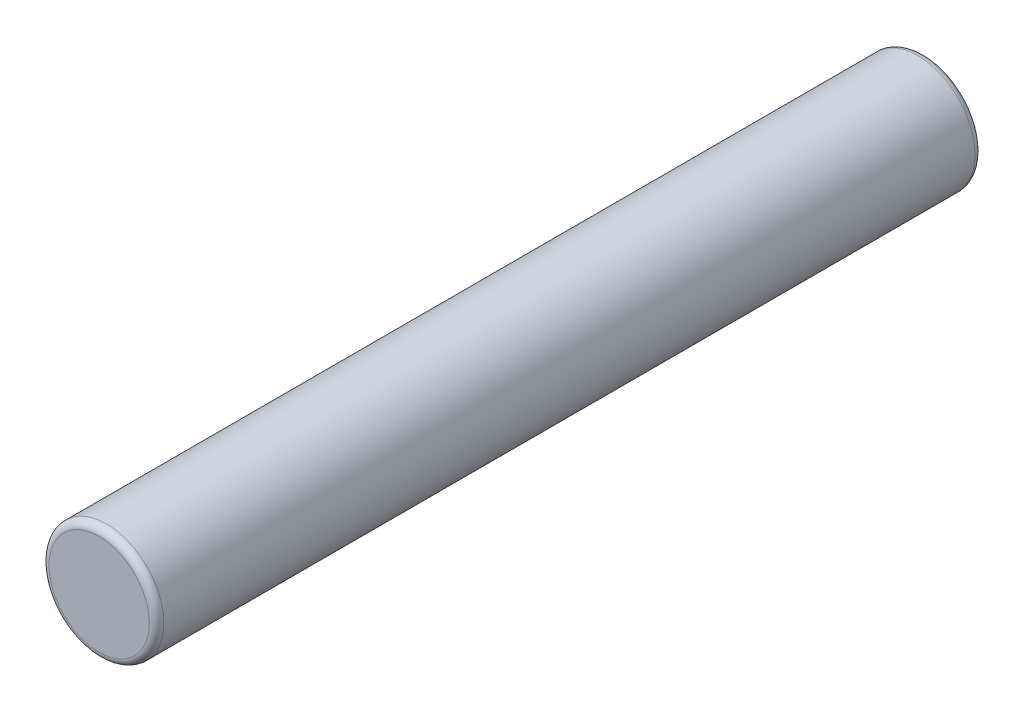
from build123d import *

# Parameters (mm, degrees)
SKETCH1_R      = 7.925
EXTRUDE1_DEPTH = 114
FILLET1_R      = 1


with BuildPart() as part:
    # Sketch1 → Extrude1 (new body)
    with BuildSketch(Plane.XY):
        with Locations(Location((0, 0, 0), (0, 0, 180))):
            Circle(SKETCH1_R)
    extrude(amount=EXTRUDE1_DEPTH)

    # Fillet1
    fillet1_edges = [part.edges().sort_by_distance(p)[0] for p in [
        (7.925, 0, 0),
        (7.925, 0, 114),
    ]]
    fillet(fillet1_edges, radius=FILLET1_R)


solid = part.part
